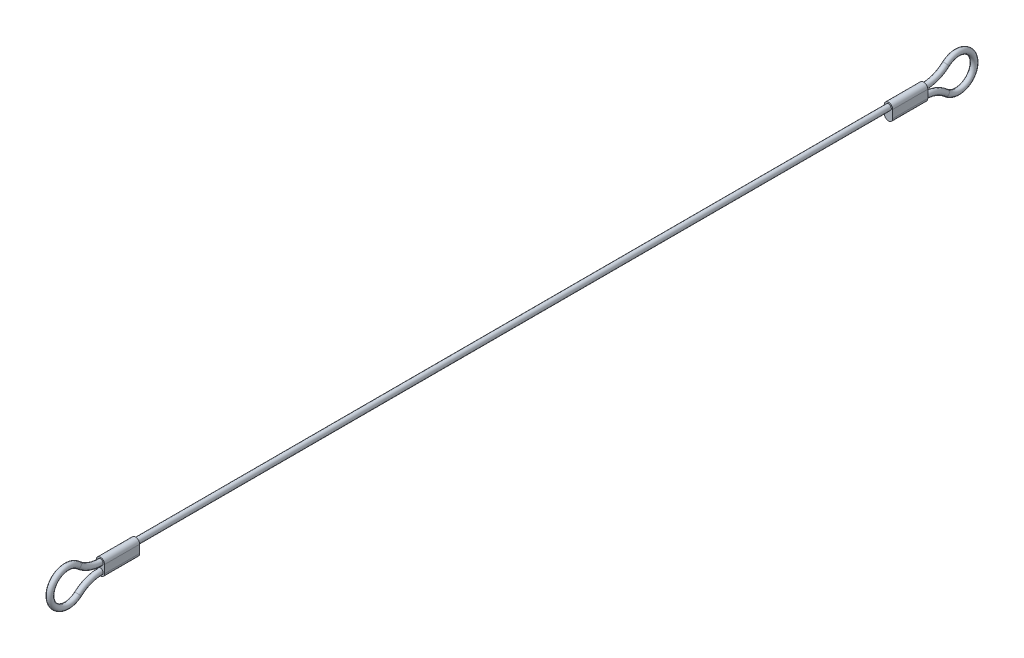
from build123d import *

# Parameters (mm, degrees)
SKETCH2_R           = 0.795
BOSS_EXTRUDE1_DEPTH = 10


with BuildPart() as part:
    # Sweep1: sweep along a path in Sketch1
    with BuildLine(Plane(origin=(0, 0, 0), x_dir=(0, 0, -1), z_dir=(1, 0, 0))) as sweep1_path:
        ThreePointArc((-117.4, -2.266252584), (-120.825492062, -2.898197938), (-123.8, -4.710835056))
        ThreePointArc((-123.8, -4.710835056), (-131.8, -1.133126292), (-123.8, 2.444582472))
        ThreePointArc((-123.8, 2.444582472), (-120.825492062, 0.631945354), (-117.4, 0))
        Line((-117.4, 0), (117.4, 0))
        ThreePointArc((117.4, 0), (120.825492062, 0.631945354), (123.8, 2.444582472))
        ThreePointArc((123.8, 2.444582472), (131.8, -1.133126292), (123.8, -4.710835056))
        ThreePointArc((123.8, -4.710835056), (120.825492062, -2.898197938), (117.4, -2.266252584))
    # Sketch2 → Sweep1 (sweep)
    with BuildSketch(Plane.XY):
        Circle(SKETCH2_R)
    sweep(path=sweep1_path.line)

    # Sketch3 → Boss-Extrude1 (add)
    with BuildSketch(Plane(origin=(0, 0, 117.4), x_dir=(-1, 0, 0), z_dir=(0, 0, -1))):
        with BuildLine():
            Line((1.2, 0), (1.2, -2.266252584))
            ThreePointArc((1.2, -2.266252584), (0, -3.466252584), (-1.2, -2.266252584))
            Line((-1.2, -2.266252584), (-1.2, 0))
            ThreePointArc((-1.2, 0), (0, 1.2), (1.2, 0))
        make_face()
    boss_extrude1 = extrude(amount=BOSS_EXTRUDE1_DEPTH)

    # Mirror1: Boss-Extrude1 across plane
    add(boss_extrude1.mirror(Plane.XY))


solid = part.part
